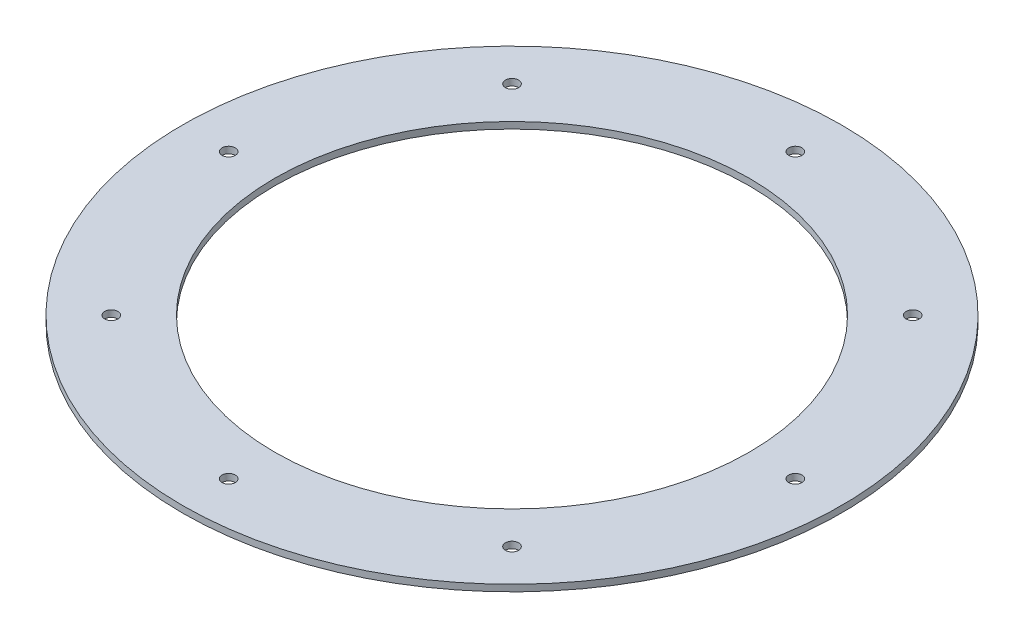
ISO-10303-21;
HEADER;
FILE_DESCRIPTION(('STEP AP214'),'2;1');
FILE_NAME('part.step','',(''),(''),'','','');
FILE_SCHEMA(('AUTOMOTIVE_DESIGN { 1 0 10303 214 1 1 1 1 }'));
ENDSEC;
DATA;
#1=APPLICATION_CONTEXT('core data for automotive mechanical design processes');
#2=APPLICATION_PROTOCOL_DEFINITION('international standard','automotive_design',2000,#1);
#3=PRODUCT_CONTEXT('',#1,'mechanical');
#4=PRODUCT('Part','Part','',(#3));
#5=PRODUCT_RELATED_PRODUCT_CATEGORY('part','',(#4));
#6=PRODUCT_DEFINITION_FORMATION('','',#4);
#7=PRODUCT_DEFINITION_CONTEXT('part definition',#1,'design');
#8=PRODUCT_DEFINITION('design','',#6,#7);
#9=PRODUCT_DEFINITION_SHAPE('','',#8);
#10=(LENGTH_UNIT() NAMED_UNIT(*) SI_UNIT(.MILLI.,.METRE.));
#11=(NAMED_UNIT(*) PLANE_ANGLE_UNIT() SI_UNIT($,.RADIAN.));
#12=(NAMED_UNIT(*) SI_UNIT($,.STERADIAN.) SOLID_ANGLE_UNIT());
#13=UNCERTAINTY_MEASURE_WITH_UNIT(LENGTH_MEASURE(1.E-05),#10,'distance_accuracy_value','');
#14=(GEOMETRIC_REPRESENTATION_CONTEXT(3) GLOBAL_UNCERTAINTY_ASSIGNED_CONTEXT((#13)) GLOBAL_UNIT_ASSIGNED_CONTEXT((#10,
#11,#12)) REPRESENTATION_CONTEXT('',''));
#15=CARTESIAN_POINT('',(0.,0.,0.));
#16=DIRECTION('',(0.,0.,1.));
#17=DIRECTION('',(1.,0.,0.));
#18=AXIS2_PLACEMENT_3D('',#15,#16,#17);
#19=CARTESIAN_POINT('',(0.,6.675,0.));
#20=DIRECTION('',(0.,1.,0.));
#21=DIRECTION('',(0.,0.,1.));
#22=AXIS2_PLACEMENT_3D('',#19,#20,#21);
#23=PLANE('',#22);
#24=CARTESIAN_POINT('',(-42.9880537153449,6.675,3.43462982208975E-12));
#25=DIRECTION('',(0.,1.,0.));
#26=DIRECTION('',(0.,0.,1.));
#27=AXIS2_PLACEMENT_3D('',#24,#25,#26);
#28=CIRCLE('',#27,1.00000000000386);
#29=CARTESIAN_POINT('',(-42.9880537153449,6.675,1.00000000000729));
#30=VERTEX_POINT('',#29);
#31=EDGE_CURVE('E83',#30,#30,#28,.T.);
#32=ORIENTED_EDGE('',*,*,#31,.F.);
#33=EDGE_LOOP('',(#32));
#34=FACE_BOUND('',#33,.T.);
#35=CARTESIAN_POINT('',(3.43809926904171E-12,6.675,42.9880537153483));
#36=DIRECTION('',(0.,1.,0.));
#37=DIRECTION('',(0.,0.,1.));
#38=AXIS2_PLACEMENT_3D('',#35,#36,#37);
#39=CIRCLE('',#38,1.00000000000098);
#40=CARTESIAN_POINT('',(3.43809926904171E-12,6.675,43.9880537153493));
#41=VERTEX_POINT('',#40);
#42=EDGE_CURVE('E71',#41,#41,#39,.T.);
#43=ORIENTED_EDGE('',*,*,#42,.F.);
#44=EDGE_LOOP('',(#43));
#45=FACE_BOUND('',#44,.T.);
#46=CARTESIAN_POINT('',(42.9880537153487,6.675,1.42247325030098E-13));
#47=DIRECTION('',(0.,1.,0.));
#48=DIRECTION('',(0.,0.,1.));
#49=AXIS2_PLACEMENT_3D('',#46,#47,#48);
#50=CIRCLE('',#49,0.999999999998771);
#51=CARTESIAN_POINT('',(42.9880537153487,6.675,0.999999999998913));
#52=VERTEX_POINT('',#51);
#53=EDGE_CURVE('E59',#52,#52,#50,.T.);
#54=ORIENTED_EDGE('',*,*,#53,.F.);
#55=EDGE_LOOP('',(#54));
#56=FACE_BOUND('',#55,.T.);
#57=CARTESIAN_POINT('',(30.3971442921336,6.675,-30.3971442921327));
#58=DIRECTION('',(0.,1.,0.));
#59=DIRECTION('',(0.,0.,1.));
#60=AXIS2_PLACEMENT_3D('',#57,#58,#59);
#61=CIRCLE('',#60,0.999999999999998);
#62=CARTESIAN_POINT('',(30.3971442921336,6.675,-29.3971442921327));
#63=VERTEX_POINT('',#62);
#64=EDGE_CURVE('E47',#63,#63,#61,.T.);
#65=ORIENTED_EDGE('',*,*,#64,.F.);
#66=EDGE_LOOP('',(#65));
#67=FACE_BOUND('',#66,.T.);
#68=CARTESIAN_POINT('',(0.,6.675,0.));
#69=DIRECTION('',(0.,1.,0.));
#70=DIRECTION('',(0.,0.,1.));
#71=AXIS2_PLACEMENT_3D('',#68,#69,#70);
#72=CIRCLE('',#71,50.0000000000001);
#73=CARTESIAN_POINT('',(0.,6.675,50.0000000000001));
#74=VERTEX_POINT('',#73);
#75=EDGE_CURVE('E10',#74,#74,#72,.T.);
#76=ORIENTED_EDGE('',*,*,#75,.T.);
#77=EDGE_LOOP('',(#76));
#78=FACE_BOUND('',#77,.T.);
#79=CARTESIAN_POINT('',(0.,6.675,0.));
#80=DIRECTION('',(0.,1.,0.));
#81=DIRECTION('',(0.,0.,1.));
#82=AXIS2_PLACEMENT_3D('',#79,#80,#81);
#83=CIRCLE('',#82,36.);
#84=CARTESIAN_POINT('',(0.,6.675,36.));
#85=VERTEX_POINT('',#84);
#86=EDGE_CURVE('E42',#85,#85,#83,.T.);
#87=ORIENTED_EDGE('',*,*,#86,.F.);
#88=EDGE_LOOP('',(#87));
#89=FACE_BOUND('',#88,.T.);
#90=CARTESIAN_POINT('',(-30.3971442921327,6.675,-30.3971442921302));
#91=DIRECTION('',(0.,1.,0.));
#92=DIRECTION('',(0.,0.,1.));
#93=AXIS2_PLACEMENT_3D('',#90,#91,#92);
#94=CIRCLE('',#93,1.00000000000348);
#95=CARTESIAN_POINT('',(-30.3971442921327,6.675,-29.3971442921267));
#96=VERTEX_POINT('',#95);
#97=EDGE_CURVE('E53',#96,#96,#94,.T.);
#98=ORIENTED_EDGE('',*,*,#97,.F.);
#99=EDGE_LOOP('',(#98));
#100=FACE_BOUND('',#99,.T.);
#101=CARTESIAN_POINT('',(30.3971442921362,6.675,30.3971442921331));
#102=DIRECTION('',(0.,1.,0.));
#103=DIRECTION('',(0.,0.,1.));
#104=AXIS2_PLACEMENT_3D('',#101,#102,#103);
#105=CIRCLE('',#104,0.999999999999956);
#106=CARTESIAN_POINT('',(30.3971442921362,6.675,31.397144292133));
#107=VERTEX_POINT('',#106);
#108=EDGE_CURVE('E65',#107,#107,#105,.T.);
#109=ORIENTED_EDGE('',*,*,#108,.F.);
#110=EDGE_LOOP('',(#109));
#111=FACE_BOUND('',#110,.T.);
#112=CARTESIAN_POINT('',(-30.3971442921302,6.675,30.3971442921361));
#113=DIRECTION('',(0.,1.,0.));
#114=DIRECTION('',(0.,0.,1.));
#115=AXIS2_PLACEMENT_3D('',#112,#113,#114);
#116=CIRCLE('',#115,1.00000000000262);
#117=CARTESIAN_POINT('',(-30.3971442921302,6.675,31.3971442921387));
#118=VERTEX_POINT('',#117);
#119=EDGE_CURVE('E77',#118,#118,#116,.T.);
#120=ORIENTED_EDGE('',*,*,#119,.F.);
#121=EDGE_LOOP('',(#120));
#122=FACE_BOUND('',#121,.T.);
#123=CARTESIAN_POINT('',(0.,6.675,-42.9880537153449));
#124=DIRECTION('',(0.,1.,0.));
#125=DIRECTION('',(0.,0.,1.));
#126=AXIS2_PLACEMENT_3D('',#123,#124,#125);
#127=CIRCLE('',#126,1.00000000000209);
#128=CARTESIAN_POINT('',(0.,6.675,-41.9880537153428));
#129=VERTEX_POINT('',#128);
#130=EDGE_CURVE('E89',#129,#129,#127,.T.);
#131=ORIENTED_EDGE('',*,*,#130,.F.);
#132=EDGE_LOOP('',(#131));
#133=FACE_BOUND('',#132,.T.);
#134=ADVANCED_FACE('F31',(#34,#45,#56,#67,#78,#89,#100,#111,#122,#133),#23,.T.);
#135=CARTESIAN_POINT('',(0.,5.675,0.));
#136=DIRECTION('',(0.,1.,0.));
#137=DIRECTION('',(0.,0.,1.));
#138=AXIS2_PLACEMENT_3D('',#135,#136,#137);
#139=PLANE('',#138);
#140=CARTESIAN_POINT('',(0.,5.675,0.));
#141=DIRECTION('',(0.,1.,0.));
#142=DIRECTION('',(0.,0.,1.));
#143=AXIS2_PLACEMENT_3D('',#140,#141,#142);
#144=CIRCLE('',#143,50.0000000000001);
#145=CARTESIAN_POINT('',(0.,5.675,50.0000000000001));
#146=VERTEX_POINT('',#145);
#147=EDGE_CURVE('E35',#146,#146,#144,.T.);
#148=ORIENTED_EDGE('',*,*,#147,.F.);
#149=EDGE_LOOP('',(#148));
#150=FACE_BOUND('',#149,.T.);
#151=CARTESIAN_POINT('',(0.,5.675,0.));
#152=DIRECTION('',(0.,1.,0.));
#153=DIRECTION('',(0.,0.,1.));
#154=AXIS2_PLACEMENT_3D('',#151,#152,#153);
#155=CIRCLE('',#154,36.);
#156=CARTESIAN_POINT('',(0.,5.675,36.));
#157=VERTEX_POINT('',#156);
#158=EDGE_CURVE('E44',#157,#157,#155,.T.);
#159=ORIENTED_EDGE('',*,*,#158,.T.);
#160=EDGE_LOOP('',(#159));
#161=FACE_BOUND('',#160,.T.);
#162=CARTESIAN_POINT('',(30.3971442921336,5.675,-30.3971442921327));
#163=DIRECTION('',(0.,1.,0.));
#164=DIRECTION('',(0.,0.,1.));
#165=AXIS2_PLACEMENT_3D('',#162,#163,#164);
#166=CIRCLE('',#165,0.999999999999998);
#167=CARTESIAN_POINT('',(30.3971442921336,5.675,-29.3971442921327));
#168=VERTEX_POINT('',#167);
#169=EDGE_CURVE('E50',#168,#168,#166,.T.);
#170=ORIENTED_EDGE('',*,*,#169,.T.);
#171=EDGE_LOOP('',(#170));
#172=FACE_BOUND('',#171,.T.);
#173=CARTESIAN_POINT('',(-30.3971442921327,5.675,-30.3971442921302));
#174=DIRECTION('',(0.,1.,0.));
#175=DIRECTION('',(0.,0.,1.));
#176=AXIS2_PLACEMENT_3D('',#173,#174,#175);
#177=CIRCLE('',#176,1.00000000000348);
#178=CARTESIAN_POINT('',(-30.3971442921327,5.675,-29.3971442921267));
#179=VERTEX_POINT('',#178);
#180=EDGE_CURVE('E56',#179,#179,#177,.T.);
#181=ORIENTED_EDGE('',*,*,#180,.T.);
#182=EDGE_LOOP('',(#181));
#183=FACE_BOUND('',#182,.T.);
#184=CARTESIAN_POINT('',(42.9880537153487,5.675,1.42247325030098E-13));
#185=DIRECTION('',(0.,1.,0.));
#186=DIRECTION('',(0.,0.,1.));
#187=AXIS2_PLACEMENT_3D('',#184,#185,#186);
#188=CIRCLE('',#187,0.999999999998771);
#189=CARTESIAN_POINT('',(42.9880537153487,5.675,0.999999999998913));
#190=VERTEX_POINT('',#189);
#191=EDGE_CURVE('E62',#190,#190,#188,.T.);
#192=ORIENTED_EDGE('',*,*,#191,.T.);
#193=EDGE_LOOP('',(#192));
#194=FACE_BOUND('',#193,.T.);
#195=CARTESIAN_POINT('',(30.3971442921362,5.675,30.3971442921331));
#196=DIRECTION('',(0.,1.,0.));
#197=DIRECTION('',(0.,0.,1.));
#198=AXIS2_PLACEMENT_3D('',#195,#196,#197);
#199=CIRCLE('',#198,0.999999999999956);
#200=CARTESIAN_POINT('',(30.3971442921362,5.675,31.397144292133));
#201=VERTEX_POINT('',#200);
#202=EDGE_CURVE('E68',#201,#201,#199,.T.);
#203=ORIENTED_EDGE('',*,*,#202,.T.);
#204=EDGE_LOOP('',(#203));
#205=FACE_BOUND('',#204,.T.);
#206=CARTESIAN_POINT('',(3.43809926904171E-12,5.675,42.9880537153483));
#207=DIRECTION('',(0.,1.,0.));
#208=DIRECTION('',(0.,0.,1.));
#209=AXIS2_PLACEMENT_3D('',#206,#207,#208);
#210=CIRCLE('',#209,1.00000000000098);
#211=CARTESIAN_POINT('',(3.43809926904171E-12,5.675,43.9880537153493));
#212=VERTEX_POINT('',#211);
#213=EDGE_CURVE('E74',#212,#212,#210,.T.);
#214=ORIENTED_EDGE('',*,*,#213,.T.);
#215=EDGE_LOOP('',(#214));
#216=FACE_BOUND('',#215,.T.);
#217=CARTESIAN_POINT('',(-30.3971442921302,5.675,30.3971442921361));
#218=DIRECTION('',(0.,1.,0.));
#219=DIRECTION('',(0.,0.,1.));
#220=AXIS2_PLACEMENT_3D('',#217,#218,#219);
#221=CIRCLE('',#220,1.00000000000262);
#222=CARTESIAN_POINT('',(-30.3971442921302,5.675,31.3971442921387));
#223=VERTEX_POINT('',#222);
#224=EDGE_CURVE('E80',#223,#223,#221,.T.);
#225=ORIENTED_EDGE('',*,*,#224,.T.);
#226=EDGE_LOOP('',(#225));
#227=FACE_BOUND('',#226,.T.);
#228=CARTESIAN_POINT('',(-42.9880537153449,5.675,3.43462982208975E-12));
#229=DIRECTION('',(0.,1.,0.));
#230=DIRECTION('',(0.,0.,1.));
#231=AXIS2_PLACEMENT_3D('',#228,#229,#230);
#232=CIRCLE('',#231,1.00000000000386);
#233=CARTESIAN_POINT('',(-42.9880537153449,5.675,1.00000000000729));
#234=VERTEX_POINT('',#233);
#235=EDGE_CURVE('E86',#234,#234,#232,.T.);
#236=ORIENTED_EDGE('',*,*,#235,.T.);
#237=EDGE_LOOP('',(#236));
#238=FACE_BOUND('',#237,.T.);
#239=CARTESIAN_POINT('',(0.,5.675,-42.9880537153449));
#240=DIRECTION('',(0.,1.,0.));
#241=DIRECTION('',(0.,0.,1.));
#242=AXIS2_PLACEMENT_3D('',#239,#240,#241);
#243=CIRCLE('',#242,1.00000000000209);
#244=CARTESIAN_POINT('',(0.,5.675,-41.9880537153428));
#245=VERTEX_POINT('',#244);
#246=EDGE_CURVE('E92',#245,#245,#243,.T.);
#247=ORIENTED_EDGE('',*,*,#246,.T.);
#248=EDGE_LOOP('',(#247));
#249=FACE_BOUND('',#248,.T.);
#250=ADVANCED_FACE('F102',(#150,#161,#172,#183,#194,#205,#216,#227,#238,#249),#139,.F.);
#251=CARTESIAN_POINT('',(0.,6.675,0.));
#252=DIRECTION('',(0.,-1.,0.));
#253=DIRECTION('',(0.,0.,-1.));
#254=AXIS2_PLACEMENT_3D('',#251,#252,#253);
#255=CYLINDRICAL_SURFACE('',#254,50.0000000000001);
#256=ORIENTED_EDGE('',*,*,#75,.F.);
#257=EDGE_LOOP('',(#256));
#258=FACE_BOUND('',#257,.T.);
#259=ORIENTED_EDGE('',*,*,#147,.T.);
#260=EDGE_LOOP('',(#259));
#261=FACE_BOUND('',#260,.T.);
#262=ADVANCED_FACE('F33',(#258,#261),#255,.T.);
#263=CARTESIAN_POINT('',(0.,6.675,0.));
#264=DIRECTION('',(0.,-1.,0.));
#265=DIRECTION('',(0.,0.,-1.));
#266=AXIS2_PLACEMENT_3D('',#263,#264,#265);
#267=CYLINDRICAL_SURFACE('',#266,36.);
#268=ORIENTED_EDGE('',*,*,#86,.T.);
#269=EDGE_LOOP('',(#268));
#270=FACE_BOUND('',#269,.T.);
#271=ORIENTED_EDGE('',*,*,#158,.F.);
#272=EDGE_LOOP('',(#271));
#273=FACE_BOUND('',#272,.T.);
#274=ADVANCED_FACE('F112',(#270,#273),#267,.F.);
#275=CARTESIAN_POINT('',(30.3971442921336,6.675,-30.3971442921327));
#276=DIRECTION('',(0.,-1.,0.));
#277=DIRECTION('',(0.,0.,-1.));
#278=AXIS2_PLACEMENT_3D('',#275,#276,#277);
#279=CYLINDRICAL_SURFACE('',#278,0.999999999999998);
#280=ORIENTED_EDGE('',*,*,#64,.T.);
#281=EDGE_LOOP('',(#280));
#282=FACE_BOUND('',#281,.T.);
#283=ORIENTED_EDGE('',*,*,#169,.F.);
#284=EDGE_LOOP('',(#283));
#285=FACE_BOUND('',#284,.T.);
#286=ADVANCED_FACE('F115',(#282,#285),#279,.F.);
#287=CARTESIAN_POINT('',(-30.3971442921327,6.675,-30.3971442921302));
#288=DIRECTION('',(0.,-1.,0.));
#289=DIRECTION('',(0.,0.,-1.));
#290=AXIS2_PLACEMENT_3D('',#287,#288,#289);
#291=CYLINDRICAL_SURFACE('',#290,1.00000000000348);
#292=ORIENTED_EDGE('',*,*,#97,.T.);
#293=EDGE_LOOP('',(#292));
#294=FACE_BOUND('',#293,.T.);
#295=ORIENTED_EDGE('',*,*,#180,.F.);
#296=EDGE_LOOP('',(#295));
#297=FACE_BOUND('',#296,.T.);
#298=ADVANCED_FACE('F119',(#294,#297),#291,.F.);
#299=CARTESIAN_POINT('',(42.9880537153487,6.675,1.42247325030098E-13));
#300=DIRECTION('',(0.,-1.,0.));
#301=DIRECTION('',(0.,0.,-1.));
#302=AXIS2_PLACEMENT_3D('',#299,#300,#301);
#303=CYLINDRICAL_SURFACE('',#302,0.999999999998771);
#304=ORIENTED_EDGE('',*,*,#53,.T.);
#305=EDGE_LOOP('',(#304));
#306=FACE_BOUND('',#305,.T.);
#307=ORIENTED_EDGE('',*,*,#191,.F.);
#308=EDGE_LOOP('',(#307));
#309=FACE_BOUND('',#308,.T.);
#310=ADVANCED_FACE('F123',(#306,#309),#303,.F.);
#311=CARTESIAN_POINT('',(30.3971442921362,6.675,30.3971442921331));
#312=DIRECTION('',(0.,-1.,0.));
#313=DIRECTION('',(0.,0.,-1.));
#314=AXIS2_PLACEMENT_3D('',#311,#312,#313);
#315=CYLINDRICAL_SURFACE('',#314,0.999999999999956);
#316=ORIENTED_EDGE('',*,*,#108,.T.);
#317=EDGE_LOOP('',(#316));
#318=FACE_BOUND('',#317,.T.);
#319=ORIENTED_EDGE('',*,*,#202,.F.);
#320=EDGE_LOOP('',(#319));
#321=FACE_BOUND('',#320,.T.);
#322=ADVANCED_FACE('F127',(#318,#321),#315,.F.);
#323=CARTESIAN_POINT('',(3.43809926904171E-12,6.675,42.9880537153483));
#324=DIRECTION('',(0.,-1.,0.));
#325=DIRECTION('',(0.,0.,-1.));
#326=AXIS2_PLACEMENT_3D('',#323,#324,#325);
#327=CYLINDRICAL_SURFACE('',#326,1.00000000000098);
#328=ORIENTED_EDGE('',*,*,#42,.T.);
#329=EDGE_LOOP('',(#328));
#330=FACE_BOUND('',#329,.T.);
#331=ORIENTED_EDGE('',*,*,#213,.F.);
#332=EDGE_LOOP('',(#331));
#333=FACE_BOUND('',#332,.T.);
#334=ADVANCED_FACE('F131',(#330,#333),#327,.F.);
#335=CARTESIAN_POINT('',(-30.3971442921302,6.675,30.3971442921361));
#336=DIRECTION('',(0.,-1.,0.));
#337=DIRECTION('',(0.,0.,-1.));
#338=AXIS2_PLACEMENT_3D('',#335,#336,#337);
#339=CYLINDRICAL_SURFACE('',#338,1.00000000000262);
#340=ORIENTED_EDGE('',*,*,#119,.T.);
#341=EDGE_LOOP('',(#340));
#342=FACE_BOUND('',#341,.T.);
#343=ORIENTED_EDGE('',*,*,#224,.F.);
#344=EDGE_LOOP('',(#343));
#345=FACE_BOUND('',#344,.T.);
#346=ADVANCED_FACE('F135',(#342,#345),#339,.F.);
#347=CARTESIAN_POINT('',(-42.9880537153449,6.675,3.43462982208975E-12));
#348=DIRECTION('',(0.,-1.,0.));
#349=DIRECTION('',(0.,0.,-1.));
#350=AXIS2_PLACEMENT_3D('',#347,#348,#349);
#351=CYLINDRICAL_SURFACE('',#350,1.00000000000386);
#352=ORIENTED_EDGE('',*,*,#31,.T.);
#353=EDGE_LOOP('',(#352));
#354=FACE_BOUND('',#353,.T.);
#355=ORIENTED_EDGE('',*,*,#235,.F.);
#356=EDGE_LOOP('',(#355));
#357=FACE_BOUND('',#356,.T.);
#358=ADVANCED_FACE('F139',(#354,#357),#351,.F.);
#359=CARTESIAN_POINT('',(0.,6.675,-42.9880537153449));
#360=DIRECTION('',(0.,-1.,0.));
#361=DIRECTION('',(0.,0.,-1.));
#362=AXIS2_PLACEMENT_3D('',#359,#360,#361);
#363=CYLINDRICAL_SURFACE('',#362,1.00000000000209);
#364=ORIENTED_EDGE('',*,*,#130,.T.);
#365=EDGE_LOOP('',(#364));
#366=FACE_BOUND('',#365,.T.);
#367=ORIENTED_EDGE('',*,*,#246,.F.);
#368=EDGE_LOOP('',(#367));
#369=FACE_BOUND('',#368,.T.);
#370=ADVANCED_FACE('F98',(#366,#369),#363,.F.);
#371=CLOSED_SHELL('',(#134,#250,#262,#274,#286,#298,#310,#322,#334,#346,#358,#370));
#372=MANIFOLD_SOLID_BREP('B2',#371);
#373=ADVANCED_BREP_SHAPE_REPRESENTATION('',(#18,#372),#14);
#374=SHAPE_DEFINITION_REPRESENTATION(#9,#373);
ENDSEC;
END-ISO-10303-21;
